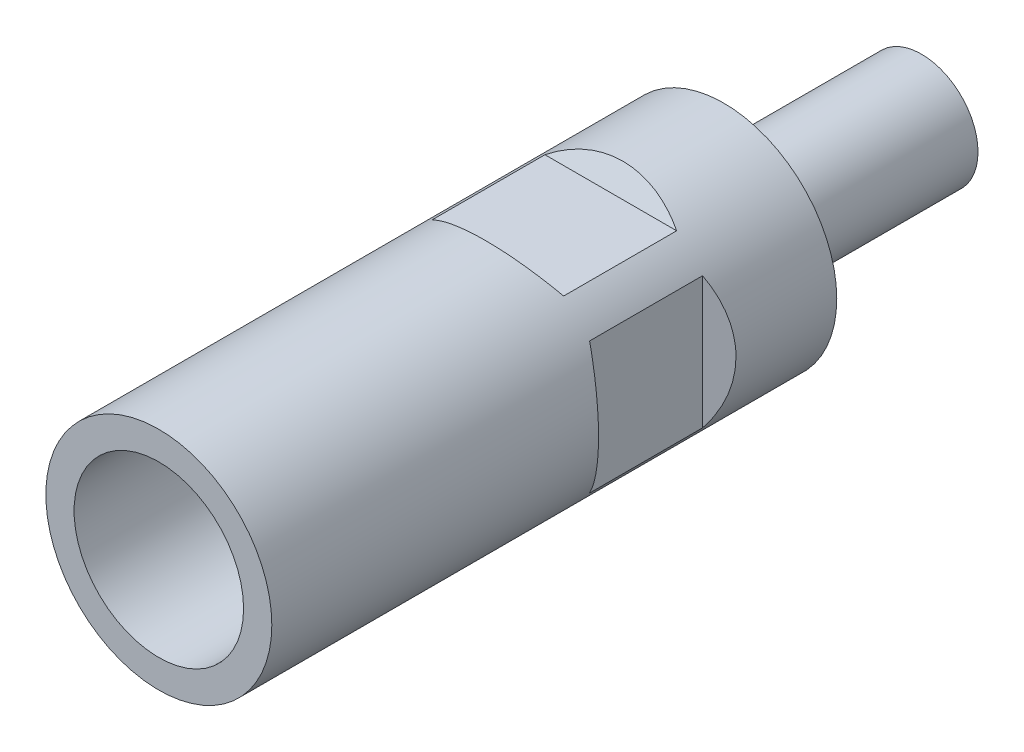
ISO-10303-21;
HEADER;
FILE_DESCRIPTION(('STEP AP214'),'2;1');
FILE_NAME('part.step','',(''),(''),'','','');
FILE_SCHEMA(('AUTOMOTIVE_DESIGN { 1 0 10303 214 1 1 1 1 }'));
ENDSEC;
DATA;
#1=APPLICATION_CONTEXT('core data for automotive mechanical design processes');
#2=APPLICATION_PROTOCOL_DEFINITION('international standard','automotive_design',2000,#1);
#3=PRODUCT_CONTEXT('',#1,'mechanical');
#4=PRODUCT('Part','Part','',(#3));
#5=PRODUCT_RELATED_PRODUCT_CATEGORY('part','',(#4));
#6=PRODUCT_DEFINITION_FORMATION('','',#4);
#7=PRODUCT_DEFINITION_CONTEXT('part definition',#1,'design');
#8=PRODUCT_DEFINITION('design','',#6,#7);
#9=PRODUCT_DEFINITION_SHAPE('','',#8);
#10=(LENGTH_UNIT() NAMED_UNIT(*) SI_UNIT(.MILLI.,.METRE.));
#11=(NAMED_UNIT(*) PLANE_ANGLE_UNIT() SI_UNIT($,.RADIAN.));
#12=(NAMED_UNIT(*) SI_UNIT($,.STERADIAN.) SOLID_ANGLE_UNIT());
#13=UNCERTAINTY_MEASURE_WITH_UNIT(LENGTH_MEASURE(1.E-05),#10,'distance_accuracy_value','');
#14=(GEOMETRIC_REPRESENTATION_CONTEXT(3) GLOBAL_UNCERTAINTY_ASSIGNED_CONTEXT((#13)) GLOBAL_UNIT_ASSIGNED_CONTEXT((#10,
#11,#12)) REPRESENTATION_CONTEXT('',''));
#15=CARTESIAN_POINT('',(0.,0.,0.));
#16=DIRECTION('',(0.,0.,1.));
#17=DIRECTION('',(1.,0.,0.));
#18=AXIS2_PLACEMENT_3D('',#15,#16,#17);
#19=CARTESIAN_POINT('',(-4.048,4.048,-14.));
#20=DIRECTION('',(0.,0.,1.));
#21=DIRECTION('',(0.,-1.,0.));
#22=AXIS2_PLACEMENT_3D('',#19,#20,#21);
#23=PLANE('',#22);
#24=CARTESIAN_POINT('',(0.,0.,-14.));
#25=DIRECTION('',(0.,0.,1.));
#26=DIRECTION('',(1.,0.,0.));
#27=AXIS2_PLACEMENT_3D('',#24,#25,#26);
#28=CIRCLE('',#27,4.);
#29=CARTESIAN_POINT('',(4.,0.,-14.));
#30=VERTEX_POINT('',#29);
#31=EDGE_CURVE('E18',#30,#30,#28,.F.);
#32=ORIENTED_EDGE('',*,*,#31,.T.);
#33=EDGE_LOOP('',(#32));
#34=FACE_BOUND('',#33,.T.);
#35=ADVANCED_FACE('F14',(#34),#23,.F.);
#36=CARTESIAN_POINT('',(0.,0.,-14.));
#37=DIRECTION('',(0.,0.,1.));
#38=DIRECTION('',(1.,0.,0.));
#39=AXIS2_PLACEMENT_3D('',#36,#37,#38);
#40=CYLINDRICAL_SURFACE('',#39,4.);
#41=CARTESIAN_POINT('',(0.,0.,-2.5));
#42=DIRECTION('',(0.,0.,1.));
#43=DIRECTION('',(1.,0.,0.));
#44=AXIS2_PLACEMENT_3D('',#41,#42,#43);
#45=CIRCLE('',#44,4.);
#46=CARTESIAN_POINT('',(4.,0.,-2.5));
#47=VERTEX_POINT('',#46);
#48=EDGE_CURVE('E106',#47,#47,#45,.F.);
#49=ORIENTED_EDGE('',*,*,#48,.T.);
#50=EDGE_LOOP('',(#49));
#51=FACE_BOUND('',#50,.T.);
#52=ORIENTED_EDGE('',*,*,#31,.F.);
#53=EDGE_LOOP('',(#52));
#54=FACE_BOUND('',#53,.T.);
#55=ADVANCED_FACE('F114',(#51,#54),#40,.T.);
#56=CARTESIAN_POINT('',(-4.048,-4.048,-2.5));
#57=DIRECTION('',(0.,0.,-1.));
#58=DIRECTION('',(0.,1.,0.));
#59=AXIS2_PLACEMENT_3D('',#56,#57,#58);
#60=PLANE('',#59);
#61=CARTESIAN_POINT('',(0.,0.,-2.5));
#62=DIRECTION('',(0.,0.,1.));
#63=DIRECTION('',(1.,0.,0.));
#64=AXIS2_PLACEMENT_3D('',#61,#62,#63);
#65=CIRCLE('',#64,3.25);
#66=CARTESIAN_POINT('',(3.25,0.,-2.5));
#67=VERTEX_POINT('',#66);
#68=EDGE_CURVE('E87',#67,#67,#65,.F.);
#69=ORIENTED_EDGE('',*,*,#68,.T.);
#70=EDGE_LOOP('',(#69));
#71=FACE_BOUND('',#70,.T.);
#72=ORIENTED_EDGE('',*,*,#48,.F.);
#73=EDGE_LOOP('',(#72));
#74=FACE_BOUND('',#73,.T.);
#75=ADVANCED_FACE('F116',(#71,#74),#60,.F.);
#76=CARTESIAN_POINT('',(0.,0.,-2.5));
#77=DIRECTION('',(0.,0.,1.));
#78=DIRECTION('',(1.,0.,0.));
#79=AXIS2_PLACEMENT_3D('',#76,#77,#78);
#80=CYLINDRICAL_SURFACE('',#79,3.25);
#81=CARTESIAN_POINT('',(0.,0.,0.));
#82=DIRECTION('',(0.,0.,1.));
#83=DIRECTION('',(1.,0.,0.));
#84=AXIS2_PLACEMENT_3D('',#81,#82,#83);
#85=CIRCLE('',#84,3.25);
#86=CARTESIAN_POINT('',(3.25,0.,0.));
#87=VERTEX_POINT('',#86);
#88=EDGE_CURVE('E98',#87,#87,#85,.F.);
#89=ORIENTED_EDGE('',*,*,#88,.T.);
#90=EDGE_LOOP('',(#89));
#91=FACE_BOUND('',#90,.T.);
#92=ORIENTED_EDGE('',*,*,#68,.F.);
#93=EDGE_LOOP('',(#92));
#94=FACE_BOUND('',#93,.T.);
#95=ADVANCED_FACE('F123',(#91,#94),#80,.T.);
#96=CARTESIAN_POINT('',(-6.5,4.719653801,16.));
#97=DIRECTION('',(0.499999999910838,0.,0.866025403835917));
#98=DIRECTION('',(-0.866025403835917,0.,0.499999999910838));
#99=AXIS2_PLACEMENT_3D('',#96,#97,#98);
#100=PLANE('',#99);
#101=CARTESIAN_POINT('',(0.,0.,12.2472232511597));
#102=DIRECTION('',(0.499999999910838,0.,0.866025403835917));
#103=DIRECTION('',(-0.866025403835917,0.,0.499999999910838));
#104=AXIS2_PLACEMENT_3D('',#101,#102,#103);
#105=ELLIPSE('',#104,9.23760430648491,8.);
#106=CARTESIAN_POINT('',(-6.49999999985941,-4.66368952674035,15.9999999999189));
#107=VERTEX_POINT('',#106);
#108=CARTESIAN_POINT('',(-6.50000000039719,4.66368952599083,16.0000000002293));
#109=VERTEX_POINT('',#108);
#110=EDGE_CURVE('E92',#107,#109,#105,.F.);
#111=ORIENTED_EDGE('',*,*,#110,.T.);
#112=DIRECTION('',(0.,-1.,0.));
#113=VECTOR('',#112,1.);
#114=CARTESIAN_POINT('',(-6.5,0.,16.));
#115=LINE('',#114,#113);
#116=EDGE_CURVE('E76',#109,#107,#115,.T.);
#117=ORIENTED_EDGE('',*,*,#116,.T.);
#118=EDGE_LOOP('',(#111,#117));
#119=FACE_BOUND('',#118,.T.);
#120=ADVANCED_FACE('F96',(#119),#100,.F.);
#121=CARTESIAN_POINT('',(-6.5,4.663689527,8.));
#122=DIRECTION('',(1.,0.,0.));
#123=DIRECTION('',(0.,0.,1.));
#124=AXIS2_PLACEMENT_3D('',#121,#122,#123);
#125=PLANE('',#124);
#126=DIRECTION('',(0.,0.,-1.));
#127=VECTOR('',#126,1.);
#128=CARTESIAN_POINT('',(-6.49999999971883,-4.66368952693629,20.));
#129=LINE('',#128,#127);
#130=CARTESIAN_POINT('',(-6.49999999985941,-4.66368952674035,8.00000000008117));
#131=VERTEX_POINT('',#130);
#132=EDGE_CURVE('E85',#131,#107,#129,.F.);
#133=ORIENTED_EDGE('',*,*,#132,.T.);
#134=ORIENTED_EDGE('',*,*,#116,.F.);
#135=DIRECTION('',(0.,0.,1.));
#136=VECTOR('',#135,1.);
#137=CARTESIAN_POINT('',(-6.50000000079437,4.66368952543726,20.));
#138=LINE('',#137,#136);
#139=CARTESIAN_POINT('',(-6.50000000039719,4.66368952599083,7.99999999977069));
#140=VERTEX_POINT('',#139);
#141=EDGE_CURVE('E84',#109,#140,#138,.F.);
#142=ORIENTED_EDGE('',*,*,#141,.T.);
#143=DIRECTION('',(0.,-1.,0.));
#144=VECTOR('',#143,1.);
#145=CARTESIAN_POINT('',(-6.5,0.,8.));
#146=LINE('',#145,#144);
#147=EDGE_CURVE('E86',#140,#131,#146,.T.);
#148=ORIENTED_EDGE('',*,*,#147,.T.);
#149=EDGE_LOOP('',(#133,#134,#142,#148));
#150=FACE_BOUND('',#149,.T.);
#151=ADVANCED_FACE('F82',(#150),#125,.F.);
#152=CARTESIAN_POINT('',(-8.009,4.719653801,7.128778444));
#153=DIRECTION('',(0.499999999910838,0.,-0.866025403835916));
#154=DIRECTION('',(0.866025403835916,0.,0.499999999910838));
#155=AXIS2_PLACEMENT_3D('',#152,#153,#154);
#156=PLANE('',#155);
#157=CARTESIAN_POINT('',(0.,0.,11.7527767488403));
#158=DIRECTION('',(0.499999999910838,0.,-0.866025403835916));
#159=DIRECTION('',(0.866025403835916,0.,0.499999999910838));
#160=AXIS2_PLACEMENT_3D('',#157,#158,#159);
#161=ELLIPSE('',#160,9.23760430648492,8.);
#162=EDGE_CURVE('E94',#140,#131,#161,.F.);
#163=ORIENTED_EDGE('',*,*,#162,.T.);
#164=ORIENTED_EDGE('',*,*,#147,.F.);
#165=EDGE_LOOP('',(#163,#164));
#166=FACE_BOUND('',#165,.T.);
#167=ADVANCED_FACE('F146',(#166),#156,.F.);
#168=CARTESIAN_POINT('',(8.009,4.719653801,16.871221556));
#169=DIRECTION('',(-0.499999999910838,0.,0.866025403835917));
#170=DIRECTION('',(-0.866025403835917,0.,-0.499999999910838));
#171=AXIS2_PLACEMENT_3D('',#168,#169,#170);
#172=PLANE('',#171);
#173=CARTESIAN_POINT('',(0.,0.,12.2472232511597));
#174=DIRECTION('',(-0.499999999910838,0.,0.866025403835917));
#175=DIRECTION('',(0.866025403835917,0.,0.499999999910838));
#176=AXIS2_PLACEMENT_3D('',#173,#174,#175);
#177=ELLIPSE('',#176,9.23760430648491,8.);
#178=CARTESIAN_POINT('',(6.50000000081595,4.66368952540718,16.0000000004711));
#179=VERTEX_POINT('',#178);
#180=CARTESIAN_POINT('',(6.49999999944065,-4.663689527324,15.9999999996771));
#181=VERTEX_POINT('',#180);
#182=EDGE_CURVE('E229',#179,#181,#177,.F.);
#183=ORIENTED_EDGE('',*,*,#182,.T.);
#184=DIRECTION('',(0.,1.,0.));
#185=VECTOR('',#184,1.);
#186=CARTESIAN_POINT('',(6.5,0.,16.));
#187=LINE('',#186,#185);
#188=EDGE_CURVE('E244',#181,#179,#187,.T.);
#189=ORIENTED_EDGE('',*,*,#188,.T.);
#190=EDGE_LOOP('',(#183,#189));
#191=FACE_BOUND('',#190,.T.);
#192=ADVANCED_FACE('F149',(#191),#172,.F.);
#193=CARTESIAN_POINT('',(6.5,4.663689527,16.));
#194=DIRECTION('',(-1.,0.,0.));
#195=DIRECTION('',(0.,0.,-1.));
#196=AXIS2_PLACEMENT_3D('',#193,#194,#195);
#197=PLANE('',#196);
#198=DIRECTION('',(0.,0.,-1.));
#199=VECTOR('',#198,1.);
#200=CARTESIAN_POINT('',(6.50000000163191,4.66368952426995,20.));
#201=LINE('',#200,#199);
#202=CARTESIAN_POINT('',(6.50000000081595,4.66368952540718,7.99999999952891));
#203=VERTEX_POINT('',#202);
#204=EDGE_CURVE('E231',#203,#179,#201,.F.);
#205=ORIENTED_EDGE('',*,*,#204,.T.);
#206=ORIENTED_EDGE('',*,*,#188,.F.);
#207=DIRECTION('',(0.,0.,1.));
#208=VECTOR('',#207,1.);
#209=CARTESIAN_POINT('',(6.49999999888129,-4.6636895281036,20.));
#210=LINE('',#209,#208);
#211=CARTESIAN_POINT('',(6.49999999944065,-4.663689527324,8.00000000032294));
#212=VERTEX_POINT('',#211);
#213=EDGE_CURVE('E228',#181,#212,#210,.F.);
#214=ORIENTED_EDGE('',*,*,#213,.T.);
#215=DIRECTION('',(0.,1.,0.));
#216=VECTOR('',#215,1.);
#217=CARTESIAN_POINT('',(6.5,0.,8.));
#218=LINE('',#217,#216);
#219=EDGE_CURVE('E245',#212,#203,#218,.T.);
#220=ORIENTED_EDGE('',*,*,#219,.T.);
#221=EDGE_LOOP('',(#205,#206,#214,#220));
#222=FACE_BOUND('',#221,.T.);
#223=ADVANCED_FACE('F153',(#222),#197,.F.);
#224=CARTESIAN_POINT('',(6.5,4.719653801,8.));
#225=DIRECTION('',(-0.499999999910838,0.,-0.866025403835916));
#226=DIRECTION('',(0.866025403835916,0.,-0.499999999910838));
#227=AXIS2_PLACEMENT_3D('',#224,#225,#226);
#228=PLANE('',#227);
#229=CARTESIAN_POINT('',(0.,0.,11.7527767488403));
#230=DIRECTION('',(-0.499999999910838,0.,-0.866025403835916));
#231=DIRECTION('',(-0.866025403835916,0.,0.499999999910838));
#232=AXIS2_PLACEMENT_3D('',#229,#230,#231);
#233=ELLIPSE('',#232,9.23760430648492,8.);
#234=EDGE_CURVE('E226',#212,#203,#233,.F.);
#235=ORIENTED_EDGE('',*,*,#234,.T.);
#236=ORIENTED_EDGE('',*,*,#219,.F.);
#237=EDGE_LOOP('',(#235,#236));
#238=FACE_BOUND('',#237,.T.);
#239=ADVANCED_FACE('F157',(#238),#228,.F.);
#240=CARTESIAN_POINT('',(-4.719653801,-8.009,7.128778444));
#241=DIRECTION('',(0.,0.499999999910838,-0.866025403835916));
#242=DIRECTION('',(0.,0.866025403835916,0.499999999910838));
#243=AXIS2_PLACEMENT_3D('',#240,#241,#242);
#244=PLANE('',#243);
#245=DIRECTION('',(-1.,0.,0.));
#246=VECTOR('',#245,1.);
#247=CARTESIAN_POINT('',(0.,-6.5,8.));
#248=LINE('',#247,#246);
#249=CARTESIAN_POINT('',(4.66368952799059,-6.49999999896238,8.00000000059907));
#250=VERTEX_POINT('',#249);
#251=CARTESIAN_POINT('',(-4.66368952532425,-6.50000000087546,7.99999999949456));
#252=VERTEX_POINT('',#251);
#253=EDGE_CURVE('E252',#250,#252,#248,.T.);
#254=ORIENTED_EDGE('',*,*,#253,.T.);
#255=CARTESIAN_POINT('',(0.,0.,11.7527767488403));
#256=DIRECTION('',(0.,0.499999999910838,-0.866025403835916));
#257=DIRECTION('',(0.,0.866025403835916,0.499999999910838));
#258=AXIS2_PLACEMENT_3D('',#255,#256,#257);
#259=ELLIPSE('',#258,9.23760430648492,8.);
#260=EDGE_CURVE('E223',#252,#250,#259,.F.);
#261=ORIENTED_EDGE('',*,*,#260,.T.);
#262=EDGE_LOOP('',(#254,#261));
#263=FACE_BOUND('',#262,.T.);
#264=ADVANCED_FACE('F161',(#263),#244,.F.);
#265=CARTESIAN_POINT('',(4.663689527,-6.5,8.));
#266=DIRECTION('',(0.,1.,0.));
#267=DIRECTION('',(-1.,0.,0.));
#268=AXIS2_PLACEMENT_3D('',#265,#266,#267);
#269=PLANE('',#268);
#270=DIRECTION('',(0.,0.,-1.));
#271=VECTOR('',#270,1.);
#272=CARTESIAN_POINT('',(4.66368952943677,-6.49999999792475,20.));
#273=LINE('',#272,#271);
#274=CARTESIAN_POINT('',(4.66368952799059,-6.49999999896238,15.9999999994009));
#275=VERTEX_POINT('',#274);
#276=EDGE_CURVE('E222',#250,#275,#273,.F.);
#277=ORIENTED_EDGE('',*,*,#276,.T.);
#278=DIRECTION('',(-1.,0.,0.));
#279=VECTOR('',#278,1.);
#280=CARTESIAN_POINT('',(0.,-6.5,16.));
#281=LINE('',#280,#279);
#282=CARTESIAN_POINT('',(-4.66368952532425,-6.50000000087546,16.0000000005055));
#283=VERTEX_POINT('',#282);
#284=EDGE_CURVE('E253',#275,#283,#281,.T.);
#285=ORIENTED_EDGE('',*,*,#284,.T.);
#286=DIRECTION('',(0.,0.,1.));
#287=VECTOR('',#286,1.);
#288=CARTESIAN_POINT('',(-4.66368952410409,-6.50000000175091,20.));
#289=LINE('',#288,#287);
#290=EDGE_CURVE('E236',#283,#252,#289,.F.);
#291=ORIENTED_EDGE('',*,*,#290,.T.);
#292=ORIENTED_EDGE('',*,*,#253,.F.);
#293=EDGE_LOOP('',(#277,#285,#291,#292));
#294=FACE_BOUND('',#293,.T.);
#295=ADVANCED_FACE('F165',(#294),#269,.F.);
#296=CARTESIAN_POINT('',(-4.719653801,-6.5,16.));
#297=DIRECTION('',(0.,0.499999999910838,0.866025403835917));
#298=DIRECTION('',(0.,-0.866025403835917,0.499999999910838));
#299=AXIS2_PLACEMENT_3D('',#296,#297,#298);
#300=PLANE('',#299);
#301=CARTESIAN_POINT('',(0.,0.,12.2472232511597));
#302=DIRECTION('',(0.,0.499999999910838,0.866025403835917));
#303=DIRECTION('',(0.,-0.866025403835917,0.499999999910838));
#304=AXIS2_PLACEMENT_3D('',#301,#302,#303);
#305=ELLIPSE('',#304,9.23760430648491,8.);
#306=EDGE_CURVE('E220',#275,#283,#305,.F.);
#307=ORIENTED_EDGE('',*,*,#306,.T.);
#308=ORIENTED_EDGE('',*,*,#284,.F.);
#309=EDGE_LOOP('',(#307,#308));
#310=FACE_BOUND('',#309,.T.);
#311=ADVANCED_FACE('F169',(#310),#300,.F.);
#312=CARTESIAN_POINT('',(-4.719653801,8.009,16.871221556));
#313=DIRECTION('',(0.,-0.499999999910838,0.866025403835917));
#314=DIRECTION('',(0.,-0.866025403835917,-0.499999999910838));
#315=AXIS2_PLACEMENT_3D('',#312,#313,#314);
#316=PLANE('',#315);
#317=DIRECTION('',(-1.,0.,0.));
#318=VECTOR('',#317,1.);
#319=CARTESIAN_POINT('',(0.,6.5,16.));
#320=LINE('',#319,#318);
#321=CARTESIAN_POINT('',(4.66368952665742,6.49999999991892,15.9999999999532));
#322=VERTEX_POINT('',#321);
#323=CARTESIAN_POINT('',(-4.66368952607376,6.50000000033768,16.000000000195));
#324=VERTEX_POINT('',#323);
#325=EDGE_CURVE('E256',#322,#324,#320,.T.);
#326=ORIENTED_EDGE('',*,*,#325,.T.);
#327=CARTESIAN_POINT('',(0.,0.,12.2472232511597));
#328=DIRECTION('',(0.,-0.499999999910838,0.866025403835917));
#329=DIRECTION('',(0.,0.866025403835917,0.499999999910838));
#330=AXIS2_PLACEMENT_3D('',#327,#328,#329);
#331=ELLIPSE('',#330,9.23760430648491,8.);
#332=EDGE_CURVE('E217',#324,#322,#331,.F.);
#333=ORIENTED_EDGE('',*,*,#332,.T.);
#334=EDGE_LOOP('',(#326,#333));
#335=FACE_BOUND('',#334,.T.);
#336=ADVANCED_FACE('F173',(#335),#316,.F.);
#337=CARTESIAN_POINT('',(-4.663689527,6.5,8.));
#338=DIRECTION('',(0.,-1.,0.));
#339=DIRECTION('',(1.,0.,0.));
#340=AXIS2_PLACEMENT_3D('',#337,#338,#339);
#341=PLANE('',#340);
#342=DIRECTION('',(0.,0.,-1.));
#343=VECTOR('',#342,1.);
#344=CARTESIAN_POINT('',(-4.66368952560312,6.50000000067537,20.));
#345=LINE('',#344,#343);
#346=CARTESIAN_POINT('',(-4.66368952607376,6.50000000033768,7.99999999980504));
#347=VERTEX_POINT('',#346);
#348=EDGE_CURVE('E240',#347,#324,#345,.F.);
#349=ORIENTED_EDGE('',*,*,#348,.T.);
#350=ORIENTED_EDGE('',*,*,#325,.F.);
#351=DIRECTION('',(0.,0.,1.));
#352=VECTOR('',#351,1.);
#353=CARTESIAN_POINT('',(4.66368952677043,6.49999999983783,20.));
#354=LINE('',#353,#352);
#355=CARTESIAN_POINT('',(4.66368952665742,6.49999999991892,8.00000000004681));
#356=VERTEX_POINT('',#355);
#357=EDGE_CURVE('E216',#322,#356,#354,.F.);
#358=ORIENTED_EDGE('',*,*,#357,.T.);
#359=DIRECTION('',(-1.,0.,0.));
#360=VECTOR('',#359,1.);
#361=CARTESIAN_POINT('',(0.,6.5,8.));
#362=LINE('',#361,#360);
#363=EDGE_CURVE('E32',#356,#347,#362,.T.);
#364=ORIENTED_EDGE('',*,*,#363,.T.);
#365=EDGE_LOOP('',(#349,#350,#358,#364));
#366=FACE_BOUND('',#365,.T.);
#367=ADVANCED_FACE('F177',(#366),#341,.F.);
#368=CARTESIAN_POINT('',(-4.719653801,6.5,8.));
#369=DIRECTION('',(0.,-0.499999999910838,-0.866025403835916));
#370=DIRECTION('',(0.,0.866025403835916,-0.499999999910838));
#371=AXIS2_PLACEMENT_3D('',#368,#369,#370);
#372=PLANE('',#371);
#373=CARTESIAN_POINT('',(0.,0.,11.7527767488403));
#374=DIRECTION('',(0.,-0.499999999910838,-0.866025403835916));
#375=DIRECTION('',(0.,-0.866025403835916,0.499999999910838));
#376=AXIS2_PLACEMENT_3D('',#373,#374,#375);
#377=ELLIPSE('',#376,9.23760430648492,8.);
#378=EDGE_CURVE('E214',#356,#347,#377,.F.);
#379=ORIENTED_EDGE('',*,*,#378,.T.);
#380=ORIENTED_EDGE('',*,*,#363,.F.);
#381=EDGE_LOOP('',(#379,#380));
#382=FACE_BOUND('',#381,.T.);
#383=ADVANCED_FACE('F181',(#382),#372,.F.);
#384=CARTESIAN_POINT('',(-8.096,8.096,0.));
#385=DIRECTION('',(0.,0.,1.));
#386=DIRECTION('',(0.,-1.,0.));
#387=AXIS2_PLACEMENT_3D('',#384,#385,#386);
#388=PLANE('',#387);
#389=ORIENTED_EDGE('',*,*,#88,.F.);
#390=EDGE_LOOP('',(#389));
#391=FACE_BOUND('',#390,.T.);
#392=CARTESIAN_POINT('',(0.,0.,0.));
#393=DIRECTION('',(0.,0.,1.));
#394=DIRECTION('',(1.,0.,0.));
#395=AXIS2_PLACEMENT_3D('',#392,#393,#394);
#396=CIRCLE('',#395,8.);
#397=CARTESIAN_POINT('',(8.,0.,0.));
#398=VERTEX_POINT('',#397);
#399=EDGE_CURVE('E211',#398,#398,#396,.F.);
#400=ORIENTED_EDGE('',*,*,#399,.T.);
#401=EDGE_LOOP('',(#400));
#402=FACE_BOUND('',#401,.T.);
#403=ADVANCED_FACE('F185',(#391,#402),#388,.F.);
#404=CARTESIAN_POINT('',(0.,0.,0.));
#405=DIRECTION('',(0.,0.,1.));
#406=DIRECTION('',(1.,0.,0.));
#407=AXIS2_PLACEMENT_3D('',#404,#405,#406);
#408=CYLINDRICAL_SURFACE('',#407,8.);
#409=ORIENTED_EDGE('',*,*,#260,.F.);
#410=ORIENTED_EDGE('',*,*,#290,.F.);
#411=ORIENTED_EDGE('',*,*,#306,.F.);
#412=ORIENTED_EDGE('',*,*,#276,.F.);
#413=EDGE_LOOP('',(#409,#410,#411,#412));
#414=FACE_BOUND('',#413,.T.);
#415=CARTESIAN_POINT('',(0.,0.,40.));
#416=DIRECTION('',(0.,0.,1.));
#417=DIRECTION('',(1.,0.,0.));
#418=AXIS2_PLACEMENT_3D('',#415,#416,#417);
#419=CIRCLE('',#418,8.);
#420=CARTESIAN_POINT('',(8.,0.,40.));
#421=VERTEX_POINT('',#420);
#422=EDGE_CURVE('E208',#421,#421,#419,.F.);
#423=ORIENTED_EDGE('',*,*,#422,.T.);
#424=EDGE_LOOP('',(#423));
#425=FACE_BOUND('',#424,.T.);
#426=ORIENTED_EDGE('',*,*,#332,.F.);
#427=ORIENTED_EDGE('',*,*,#348,.F.);
#428=ORIENTED_EDGE('',*,*,#378,.F.);
#429=ORIENTED_EDGE('',*,*,#357,.F.);
#430=EDGE_LOOP('',(#426,#427,#428,#429));
#431=FACE_BOUND('',#430,.T.);
#432=ORIENTED_EDGE('',*,*,#399,.F.);
#433=EDGE_LOOP('',(#432));
#434=FACE_BOUND('',#433,.T.);
#435=ORIENTED_EDGE('',*,*,#213,.F.);
#436=ORIENTED_EDGE('',*,*,#182,.F.);
#437=ORIENTED_EDGE('',*,*,#204,.F.);
#438=ORIENTED_EDGE('',*,*,#234,.F.);
#439=EDGE_LOOP('',(#435,#436,#437,#438));
#440=FACE_BOUND('',#439,.T.);
#441=ORIENTED_EDGE('',*,*,#141,.F.);
#442=ORIENTED_EDGE('',*,*,#110,.F.);
#443=ORIENTED_EDGE('',*,*,#132,.F.);
#444=ORIENTED_EDGE('',*,*,#162,.F.);
#445=EDGE_LOOP('',(#441,#442,#443,#444));
#446=FACE_BOUND('',#445,.T.);
#447=ADVANCED_FACE('F91',(#414,#425,#431,#434,#440,#446),#408,.T.);
#448=CARTESIAN_POINT('',(-8.096,-8.096,40.));
#449=DIRECTION('',(0.,0.,-1.));
#450=DIRECTION('',(0.,1.,0.));
#451=AXIS2_PLACEMENT_3D('',#448,#449,#450);
#452=PLANE('',#451);
#453=CARTESIAN_POINT('',(0.,0.,40.));
#454=DIRECTION('',(0.,0.,1.));
#455=DIRECTION('',(1.,0.,0.));
#456=AXIS2_PLACEMENT_3D('',#453,#454,#455);
#457=CIRCLE('',#456,6.);
#458=CARTESIAN_POINT('',(6.,0.,40.));
#459=VERTEX_POINT('',#458);
#460=EDGE_CURVE('E203',#459,#459,#457,.T.);
#461=ORIENTED_EDGE('',*,*,#460,.F.);
#462=EDGE_LOOP('',(#461));
#463=FACE_BOUND('',#462,.T.);
#464=ORIENTED_EDGE('',*,*,#422,.F.);
#465=EDGE_LOOP('',(#464));
#466=FACE_BOUND('',#465,.T.);
#467=ADVANCED_FACE('F189',(#463,#466),#452,.F.);
#468=CARTESIAN_POINT('',(0.,0.,21.));
#469=DIRECTION('',(0.,0.,1.));
#470=DIRECTION('',(1.,0.,0.));
#471=AXIS2_PLACEMENT_3D('',#468,#469,#470);
#472=CYLINDRICAL_SURFACE('',#471,6.);
#473=ORIENTED_EDGE('',*,*,#460,.T.);
#474=EDGE_LOOP('',(#473));
#475=FACE_BOUND('',#474,.T.);
#476=CARTESIAN_POINT('',(0.,0.,21.));
#477=DIRECTION('',(0.,0.,1.));
#478=DIRECTION('',(1.,0.,0.));
#479=AXIS2_PLACEMENT_3D('',#476,#477,#478);
#480=CIRCLE('',#479,6.);
#481=CARTESIAN_POINT('',(6.,0.,21.));
#482=VERTEX_POINT('',#481);
#483=EDGE_CURVE('E200',#482,#482,#480,.T.);
#484=ORIENTED_EDGE('',*,*,#483,.F.);
#485=EDGE_LOOP('',(#484));
#486=FACE_BOUND('',#485,.T.);
#487=ADVANCED_FACE('F139',(#475,#486),#472,.F.);
#488=CARTESIAN_POINT('',(-3.036,3.036,7.));
#489=DIRECTION('',(0.,0.,1.));
#490=DIRECTION('',(0.,-1.,0.));
#491=AXIS2_PLACEMENT_3D('',#488,#489,#490);
#492=PLANE('',#491);
#493=CARTESIAN_POINT('',(0.,0.,7.));
#494=DIRECTION('',(0.,0.,1.));
#495=DIRECTION('',(1.,0.,0.));
#496=AXIS2_PLACEMENT_3D('',#493,#494,#495);
#497=CIRCLE('',#496,3.);
#498=CARTESIAN_POINT('',(3.,0.,7.));
#499=VERTEX_POINT('',#498);
#500=EDGE_CURVE('E24',#499,#499,#497,.F.);
#501=ORIENTED_EDGE('',*,*,#500,.F.);
#502=EDGE_LOOP('',(#501));
#503=FACE_BOUND('',#502,.T.);
#504=ADVANCED_FACE('F135',(#503),#492,.T.);
#505=CARTESIAN_POINT('',(-6.072,6.072,21.));
#506=DIRECTION('',(0.,0.,1.));
#507=DIRECTION('',(0.,-1.,0.));
#508=AXIS2_PLACEMENT_3D('',#505,#506,#507);
#509=PLANE('',#508);
#510=CARTESIAN_POINT('',(0.,0.,21.));
#511=DIRECTION('',(0.,0.,1.));
#512=DIRECTION('',(1.,0.,0.));
#513=AXIS2_PLACEMENT_3D('',#510,#511,#512);
#514=CIRCLE('',#513,3.);
#515=CARTESIAN_POINT('',(3.,0.,21.));
#516=VERTEX_POINT('',#515);
#517=EDGE_CURVE('E9',#516,#516,#514,.T.);
#518=ORIENTED_EDGE('',*,*,#517,.F.);
#519=EDGE_LOOP('',(#518));
#520=FACE_BOUND('',#519,.T.);
#521=ORIENTED_EDGE('',*,*,#483,.T.);
#522=EDGE_LOOP('',(#521));
#523=FACE_BOUND('',#522,.T.);
#524=ADVANCED_FACE('F16',(#520,#523),#509,.T.);
#525=CARTESIAN_POINT('',(0.,0.,7.));
#526=DIRECTION('',(0.,0.,1.));
#527=DIRECTION('',(1.,0.,0.));
#528=AXIS2_PLACEMENT_3D('',#525,#526,#527);
#529=CYLINDRICAL_SURFACE('',#528,3.);
#530=ORIENTED_EDGE('',*,*,#517,.T.);
#531=EDGE_LOOP('',(#530));
#532=FACE_BOUND('',#531,.T.);
#533=ORIENTED_EDGE('',*,*,#500,.T.);
#534=EDGE_LOOP('',(#533));
#535=FACE_BOUND('',#534,.T.);
#536=ADVANCED_FACE('F128',(#532,#535),#529,.F.);
#537=CLOSED_SHELL('',(#35,#55,#75,#95,#120,#151,#167,#192,#223,#239,#264,#295,#311,#336,#367,
#383,#403,#447,#467,#487,#504,#524,#536));
#538=MANIFOLD_SOLID_BREP('B1',#537);
#539=ADVANCED_BREP_SHAPE_REPRESENTATION('',(#18,#538),#14);
#540=SHAPE_DEFINITION_REPRESENTATION(#9,#539);
ENDSEC;
END-ISO-10303-21;
